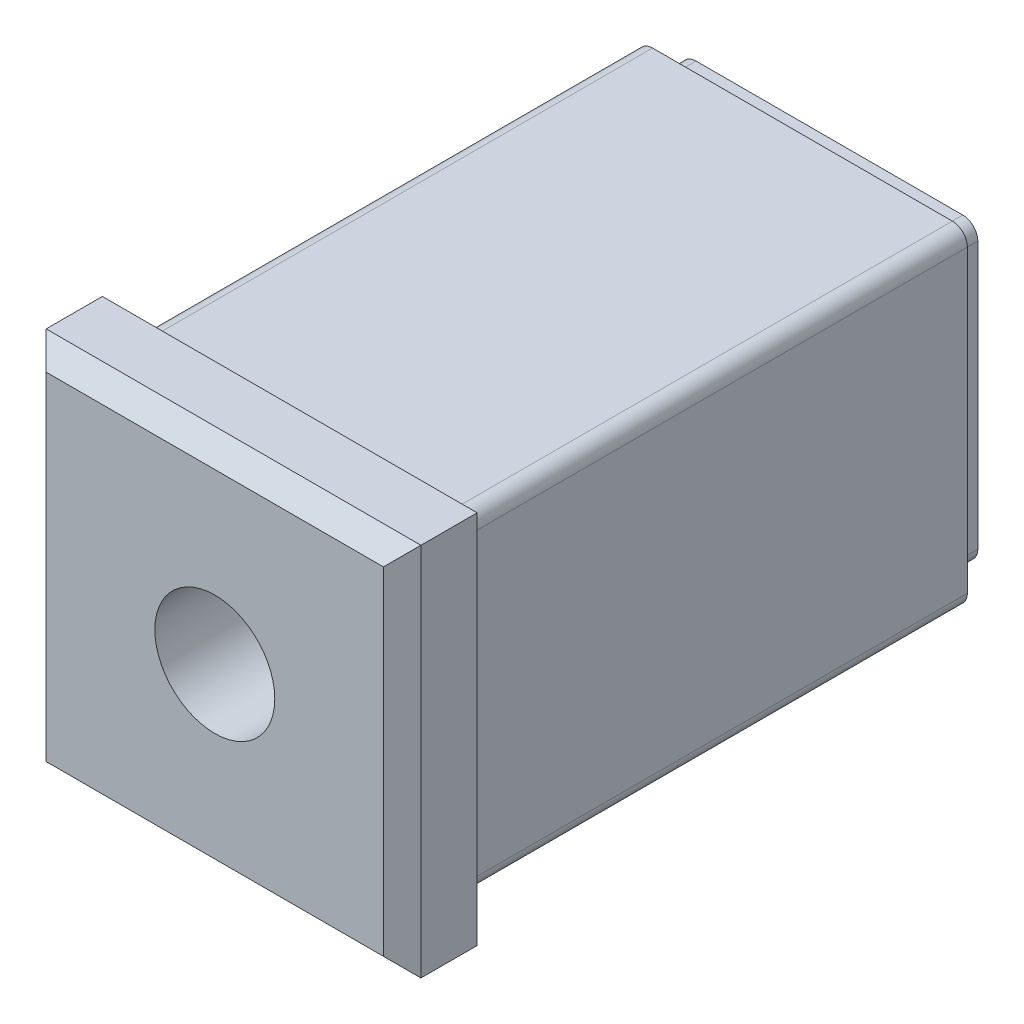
ISO-10303-21;
HEADER;
FILE_DESCRIPTION(('STEP AP214'),'2;1');
FILE_NAME('part.step','',(''),(''),'','','');
FILE_SCHEMA(('AUTOMOTIVE_DESIGN { 1 0 10303 214 1 1 1 1 }'));
ENDSEC;
DATA;
#1=APPLICATION_CONTEXT('core data for automotive mechanical design processes');
#2=APPLICATION_PROTOCOL_DEFINITION('international standard','automotive_design',2000,#1);
#3=PRODUCT_CONTEXT('',#1,'mechanical');
#4=PRODUCT('Part','Part','',(#3));
#5=PRODUCT_RELATED_PRODUCT_CATEGORY('part','',(#4));
#6=PRODUCT_DEFINITION_FORMATION('','',#4);
#7=PRODUCT_DEFINITION_CONTEXT('part definition',#1,'design');
#8=PRODUCT_DEFINITION('design','',#6,#7);
#9=PRODUCT_DEFINITION_SHAPE('','',#8);
#10=(LENGTH_UNIT() NAMED_UNIT(*) SI_UNIT(.MILLI.,.METRE.));
#11=(NAMED_UNIT(*) PLANE_ANGLE_UNIT() SI_UNIT($,.RADIAN.));
#12=(NAMED_UNIT(*) SI_UNIT($,.STERADIAN.) SOLID_ANGLE_UNIT());
#13=UNCERTAINTY_MEASURE_WITH_UNIT(LENGTH_MEASURE(1.E-05),#10,'distance_accuracy_value','');
#14=(GEOMETRIC_REPRESENTATION_CONTEXT(3) GLOBAL_UNCERTAINTY_ASSIGNED_CONTEXT((#13)) GLOBAL_UNIT_ASSIGNED_CONTEXT((#10,
#11,#12)) REPRESENTATION_CONTEXT('',''));
#15=CARTESIAN_POINT('',(0.,0.,0.));
#16=DIRECTION('',(0.,0.,1.));
#17=DIRECTION('',(1.,0.,0.));
#18=AXIS2_PLACEMENT_3D('',#15,#16,#17);
#19=CARTESIAN_POINT('',(-11.25,0.,5.));
#20=DIRECTION('',(0.,0.,1.));
#21=DIRECTION('',(0.,1.,0.));
#22=AXIS2_PLACEMENT_3D('',#19,#20,#21);
#23=PLANE('',#22);
#24=DIRECTION('',(0.,-1.,0.));
#25=VECTOR('',#24,1.);
#26=CARTESIAN_POINT('',(11.25,0.,5.));
#27=LINE('',#26,#25);
#28=CARTESIAN_POINT('',(11.25,11.25,5.));
#29=VERTEX_POINT('',#28);
#30=CARTESIAN_POINT('',(11.25,-11.25,5.));
#31=VERTEX_POINT('',#30);
#32=EDGE_CURVE('E237',#29,#31,#27,.T.);
#33=ORIENTED_EDGE('',*,*,#32,.F.);
#34=DIRECTION('',(-1.,0.,0.));
#35=VECTOR('',#34,1.);
#36=CARTESIAN_POINT('',(-25.,11.25,5.));
#37=LINE('',#36,#35);
#38=CARTESIAN_POINT('',(-11.25,11.25,5.));
#39=VERTEX_POINT('',#38);
#40=EDGE_CURVE('E188',#29,#39,#37,.T.);
#41=ORIENTED_EDGE('',*,*,#40,.T.);
#42=DIRECTION('',(0.,-1.,0.));
#43=VECTOR('',#42,1.);
#44=CARTESIAN_POINT('',(-11.25,0.,5.));
#45=LINE('',#44,#43);
#46=CARTESIAN_POINT('',(-11.25,-11.25,5.));
#47=VERTEX_POINT('',#46);
#48=EDGE_CURVE('E347',#47,#39,#45,.F.);
#49=ORIENTED_EDGE('',*,*,#48,.F.);
#50=DIRECTION('',(-1.,0.,0.));
#51=VECTOR('',#50,1.);
#52=CARTESIAN_POINT('',(36.,-11.25,5.));
#53=LINE('',#52,#51);
#54=EDGE_CURVE('E360',#47,#31,#53,.F.);
#55=ORIENTED_EDGE('',*,*,#54,.T.);
#56=EDGE_LOOP('',(#33,#41,#49,#55));
#57=FACE_BOUND('',#56,.T.);
#58=CARTESIAN_POINT('',(0.,0.,5.));
#59=DIRECTION('',(0.,0.,1.));
#60=DIRECTION('',(0.,1.,0.));
#61=AXIS2_PLACEMENT_3D('',#58,#59,#60);
#62=CIRCLE('',#61,4.);
#63=CARTESIAN_POINT('',(0.,4.,5.));
#64=VERTEX_POINT('',#63);
#65=EDGE_CURVE('E191',#64,#64,#62,.F.);
#66=ORIENTED_EDGE('',*,*,#65,.T.);
#67=EDGE_LOOP('',(#66));
#68=FACE_BOUND('',#67,.T.);
#69=ADVANCED_FACE('F14',(#57,#68),#23,.T.);
#70=CARTESIAN_POINT('',(36.,-12.5,3.75));
#71=DIRECTION('',(0.,0.707106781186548,-0.707106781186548));
#72=DIRECTION('',(0.,-0.707106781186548,-0.707106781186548));
#73=AXIS2_PLACEMENT_3D('',#70,#71,#72);
#74=PLANE('',#73);
#75=DIRECTION('',(1.,0.,0.));
#76=VECTOR('',#75,1.);
#77=CARTESIAN_POINT('',(0.,-12.5,3.75));
#78=LINE('',#77,#76);
#79=CARTESIAN_POINT('',(-12.5,-12.5,3.75));
#80=VERTEX_POINT('',#79);
#81=CARTESIAN_POINT('',(12.5,-12.5,3.75));
#82=VERTEX_POINT('',#81);
#83=EDGE_CURVE('E338',#80,#82,#78,.T.);
#84=ORIENTED_EDGE('',*,*,#83,.T.);
#85=DIRECTION('',(0.577350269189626,-0.577350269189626,-0.577350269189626));
#86=VECTOR('',#85,1.);
#87=CARTESIAN_POINT('',(11.25,-11.25,5.));
#88=LINE('',#87,#86);
#89=EDGE_CURVE('E363',#31,#82,#88,.T.);
#90=ORIENTED_EDGE('',*,*,#89,.F.);
#91=ORIENTED_EDGE('',*,*,#54,.F.);
#92=DIRECTION('',(0.577350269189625,0.577350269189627,0.577350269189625));
#93=VECTOR('',#92,1.);
#94=CARTESIAN_POINT('',(-12.5,-12.5,3.75));
#95=LINE('',#94,#93);
#96=EDGE_CURVE('E349',#80,#47,#95,.T.);
#97=ORIENTED_EDGE('',*,*,#96,.F.);
#98=EDGE_LOOP('',(#84,#90,#91,#97));
#99=FACE_BOUND('',#98,.T.);
#100=ADVANCED_FACE('F441',(#99),#74,.F.);
#101=CARTESIAN_POINT('',(11.25,0.,5.));
#102=DIRECTION('',(0.707106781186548,0.,0.707106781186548));
#103=DIRECTION('',(-0.707106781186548,0.,0.707106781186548));
#104=AXIS2_PLACEMENT_3D('',#101,#102,#103);
#105=PLANE('',#104);
#106=DIRECTION('',(0.,-1.,0.));
#107=VECTOR('',#106,1.);
#108=CARTESIAN_POINT('',(12.5,0.,3.75));
#109=LINE('',#108,#107);
#110=CARTESIAN_POINT('',(12.5,12.5,3.75));
#111=VERTEX_POINT('',#110);
#112=EDGE_CURVE('E18',#111,#82,#109,.T.);
#113=ORIENTED_EDGE('',*,*,#112,.F.);
#114=DIRECTION('',(-0.577350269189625,-0.577350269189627,0.577350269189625));
#115=VECTOR('',#114,1.);
#116=CARTESIAN_POINT('',(12.5,12.5,3.75));
#117=LINE('',#116,#115);
#118=EDGE_CURVE('E164',#111,#29,#117,.T.);
#119=ORIENTED_EDGE('',*,*,#118,.T.);
#120=ORIENTED_EDGE('',*,*,#32,.T.);
#121=ORIENTED_EDGE('',*,*,#89,.T.);
#122=EDGE_LOOP('',(#113,#119,#120,#121));
#123=FACE_BOUND('',#122,.T.);
#124=ADVANCED_FACE('F443',(#123),#105,.T.);
#125=CARTESIAN_POINT('',(-12.5,0.,3.75));
#126=DIRECTION('',(-0.707106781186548,0.,0.707106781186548));
#127=DIRECTION('',(-0.707106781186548,0.,-0.707106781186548));
#128=AXIS2_PLACEMENT_3D('',#125,#126,#127);
#129=PLANE('',#128);
#130=ORIENTED_EDGE('',*,*,#48,.T.);
#131=DIRECTION('',(-0.577350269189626,0.577350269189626,-0.577350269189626));
#132=VECTOR('',#131,1.);
#133=CARTESIAN_POINT('',(-11.25,11.25,5.));
#134=LINE('',#133,#132);
#135=CARTESIAN_POINT('',(-12.5,12.5,3.75));
#136=VERTEX_POINT('',#135);
#137=EDGE_CURVE('E187',#39,#136,#134,.T.);
#138=ORIENTED_EDGE('',*,*,#137,.T.);
#139=DIRECTION('',(0.,1.,0.));
#140=VECTOR('',#139,1.);
#141=CARTESIAN_POINT('',(-12.5,0.,3.75));
#142=LINE('',#141,#140);
#143=EDGE_CURVE('E333',#80,#136,#142,.T.);
#144=ORIENTED_EDGE('',*,*,#143,.F.);
#145=ORIENTED_EDGE('',*,*,#96,.T.);
#146=EDGE_LOOP('',(#130,#138,#144,#145));
#147=FACE_BOUND('',#146,.T.);
#148=ADVANCED_FACE('F446',(#147),#129,.T.);
#149=CARTESIAN_POINT('',(12.5,0.,-36.));
#150=DIRECTION('',(0.,0.,-1.));
#151=DIRECTION('',(0.,-1.,0.));
#152=AXIS2_PLACEMENT_3D('',#149,#150,#151);
#153=PLANE('',#152);
#154=DIRECTION('',(1.,0.,0.));
#155=VECTOR('',#154,1.);
#156=CARTESIAN_POINT('',(8.9,-9.9,-36.));
#157=LINE('',#156,#155);
#158=CARTESIAN_POINT('',(8.9,-9.9,-36.));
#159=VERTEX_POINT('',#158);
#160=CARTESIAN_POINT('',(-8.9,-9.9,-36.));
#161=VERTEX_POINT('',#160);
#162=EDGE_CURVE('E322',#159,#161,#157,.F.);
#163=ORIENTED_EDGE('',*,*,#162,.T.);
#164=CARTESIAN_POINT('',(-8.9,-8.9,-36.));
#165=DIRECTION('',(0.,0.,1.));
#166=DIRECTION('',(0.,1.,0.));
#167=AXIS2_PLACEMENT_3D('',#164,#165,#166);
#168=CIRCLE('',#167,1.);
#169=CARTESIAN_POINT('',(-9.9,-8.9,-36.));
#170=VERTEX_POINT('',#169);
#171=EDGE_CURVE('E375',#161,#170,#168,.F.);
#172=ORIENTED_EDGE('',*,*,#171,.T.);
#173=DIRECTION('',(0.,-1.,0.));
#174=VECTOR('',#173,1.);
#175=CARTESIAN_POINT('',(-9.9,-8.9,-36.));
#176=LINE('',#175,#174);
#177=CARTESIAN_POINT('',(-9.9,8.9,-36.));
#178=VERTEX_POINT('',#177);
#179=EDGE_CURVE('E327',#170,#178,#176,.F.);
#180=ORIENTED_EDGE('',*,*,#179,.T.);
#181=CARTESIAN_POINT('',(-8.9,8.9,-36.));
#182=DIRECTION('',(0.,0.,1.));
#183=DIRECTION('',(0.,1.,0.));
#184=AXIS2_PLACEMENT_3D('',#181,#182,#183);
#185=CIRCLE('',#184,1.);
#186=CARTESIAN_POINT('',(-8.9,9.9,-36.));
#187=VERTEX_POINT('',#186);
#188=EDGE_CURVE('E211',#178,#187,#185,.F.);
#189=ORIENTED_EDGE('',*,*,#188,.T.);
#190=DIRECTION('',(-1.,0.,0.));
#191=VECTOR('',#190,1.);
#192=CARTESIAN_POINT('',(-8.9,9.9,-36.));
#193=LINE('',#192,#191);
#194=CARTESIAN_POINT('',(8.9,9.9,-36.));
#195=VERTEX_POINT('',#194);
#196=EDGE_CURVE('E181',#187,#195,#193,.F.);
#197=ORIENTED_EDGE('',*,*,#196,.T.);
#198=CARTESIAN_POINT('',(8.9,8.9,-36.));
#199=DIRECTION('',(0.,0.,1.));
#200=DIRECTION('',(0.,1.,0.));
#201=AXIS2_PLACEMENT_3D('',#198,#199,#200);
#202=CIRCLE('',#201,1.);
#203=CARTESIAN_POINT('',(9.9,8.9,-36.));
#204=VERTEX_POINT('',#203);
#205=EDGE_CURVE('E193',#195,#204,#202,.F.);
#206=ORIENTED_EDGE('',*,*,#205,.T.);
#207=DIRECTION('',(0.,1.,0.));
#208=VECTOR('',#207,1.);
#209=CARTESIAN_POINT('',(9.9,8.9,-36.));
#210=LINE('',#209,#208);
#211=CARTESIAN_POINT('',(9.9,-8.9,-36.));
#212=VERTEX_POINT('',#211);
#213=EDGE_CURVE('E167',#204,#212,#210,.F.);
#214=ORIENTED_EDGE('',*,*,#213,.T.);
#215=CARTESIAN_POINT('',(8.9,-8.9,-36.));
#216=DIRECTION('',(0.,0.,1.));
#217=DIRECTION('',(0.,1.,0.));
#218=AXIS2_PLACEMENT_3D('',#215,#216,#217);
#219=CIRCLE('',#218,1.);
#220=EDGE_CURVE('E377',#212,#159,#219,.F.);
#221=ORIENTED_EDGE('',*,*,#220,.T.);
#222=EDGE_LOOP('',(#163,#172,#180,#189,#197,#206,#214,#221));
#223=FACE_BOUND('',#222,.T.);
#224=CARTESIAN_POINT('',(0.,0.,-36.));
#225=DIRECTION('',(0.,0.,-1.));
#226=DIRECTION('',(0.,-1.,0.));
#227=AXIS2_PLACEMENT_3D('',#224,#225,#226);
#228=CIRCLE('',#227,4.);
#229=CARTESIAN_POINT('',(0.,-4.,-36.));
#230=VERTEX_POINT('',#229);
#231=EDGE_CURVE('E651',#230,#230,#228,.T.);
#232=ORIENTED_EDGE('',*,*,#231,.F.);
#233=EDGE_LOOP('',(#232));
#234=FACE_BOUND('',#233,.T.);
#235=ADVANCED_FACE('F389',(#223,#234),#153,.T.);
#236=CARTESIAN_POINT('',(-12.5,0.,-36.));
#237=DIRECTION('',(-1.,0.,0.));
#238=DIRECTION('',(0.,1.,0.));
#239=AXIS2_PLACEMENT_3D('',#236,#237,#238);
#240=PLANE('',#239);
#241=ORIENTED_EDGE('',*,*,#143,.T.);
#242=DIRECTION('',(0.,0.,-1.));
#243=VECTOR('',#242,1.);
#244=CARTESIAN_POINT('',(-12.5,12.5,5.));
#245=LINE('',#244,#243);
#246=CARTESIAN_POINT('',(-12.5,12.5,0.));
#247=VERTEX_POINT('',#246);
#248=EDGE_CURVE('E174',#136,#247,#245,.T.);
#249=ORIENTED_EDGE('',*,*,#248,.T.);
#250=DIRECTION('',(0.,-1.,0.));
#251=VECTOR('',#250,1.);
#252=CARTESIAN_POINT('',(-12.5,0.,0.));
#253=LINE('',#252,#251);
#254=CARTESIAN_POINT('',(-12.5,-12.5,0.));
#255=VERTEX_POINT('',#254);
#256=EDGE_CURVE('E309',#255,#247,#253,.F.);
#257=ORIENTED_EDGE('',*,*,#256,.F.);
#258=DIRECTION('',(0.,0.,-1.));
#259=VECTOR('',#258,1.);
#260=CARTESIAN_POINT('',(-12.5,-12.5,-36.));
#261=LINE('',#260,#259);
#262=EDGE_CURVE('E337',#255,#80,#261,.F.);
#263=ORIENTED_EDGE('',*,*,#262,.T.);
#264=EDGE_LOOP('',(#241,#249,#257,#263));
#265=FACE_BOUND('',#264,.T.);
#266=ADVANCED_FACE('F467',(#265),#240,.T.);
#267=CARTESIAN_POINT('',(0.,-12.5,5.));
#268=DIRECTION('',(0.,1.,0.));
#269=DIRECTION('',(1.,0.,0.));
#270=AXIS2_PLACEMENT_3D('',#267,#268,#269);
#271=PLANE('',#270);
#272=DIRECTION('',(0.,0.,-1.));
#273=VECTOR('',#272,1.);
#274=CARTESIAN_POINT('',(12.5,-12.5,5.));
#275=LINE('',#274,#273);
#276=CARTESIAN_POINT('',(12.5,-12.5,0.));
#277=VERTEX_POINT('',#276);
#278=EDGE_CURVE('E334',#82,#277,#275,.T.);
#279=ORIENTED_EDGE('',*,*,#278,.F.);
#280=ORIENTED_EDGE('',*,*,#83,.F.);
#281=ORIENTED_EDGE('',*,*,#262,.F.);
#282=DIRECTION('',(-1.,0.,0.));
#283=VECTOR('',#282,1.);
#284=CARTESIAN_POINT('',(0.,-12.5,0.));
#285=LINE('',#284,#283);
#286=EDGE_CURVE('E312',#277,#255,#285,.T.);
#287=ORIENTED_EDGE('',*,*,#286,.F.);
#288=EDGE_LOOP('',(#279,#280,#281,#287));
#289=FACE_BOUND('',#288,.T.);
#290=ADVANCED_FACE('F470',(#289),#271,.F.);
#291=CARTESIAN_POINT('',(12.5,0.,3.75));
#292=DIRECTION('',(1.,0.,0.));
#293=DIRECTION('',(0.,-1.,0.));
#294=AXIS2_PLACEMENT_3D('',#291,#292,#293);
#295=PLANE('',#294);
#296=ORIENTED_EDGE('',*,*,#112,.T.);
#297=ORIENTED_EDGE('',*,*,#278,.T.);
#298=DIRECTION('',(0.,-1.,0.));
#299=VECTOR('',#298,1.);
#300=CARTESIAN_POINT('',(12.5,0.,0.));
#301=LINE('',#300,#299);
#302=CARTESIAN_POINT('',(12.5,12.5,0.));
#303=VERTEX_POINT('',#302);
#304=EDGE_CURVE('E315',#303,#277,#301,.T.);
#305=ORIENTED_EDGE('',*,*,#304,.F.);
#306=DIRECTION('',(0.,0.,-1.));
#307=VECTOR('',#306,1.);
#308=CARTESIAN_POINT('',(12.5,12.5,-36.));
#309=LINE('',#308,#307);
#310=EDGE_CURVE('E169',#303,#111,#309,.F.);
#311=ORIENTED_EDGE('',*,*,#310,.T.);
#312=EDGE_LOOP('',(#296,#297,#305,#311));
#313=FACE_BOUND('',#312,.T.);
#314=ADVANCED_FACE('F474',(#313),#295,.T.);
#315=CARTESIAN_POINT('',(10.,-11.,0.));
#316=DIRECTION('',(0.,1.,0.));
#317=DIRECTION('',(1.,0.,0.));
#318=AXIS2_PLACEMENT_3D('',#315,#316,#317);
#319=PLANE('',#318);
#320=DIRECTION('',(0.,0.,-1.));
#321=VECTOR('',#320,1.);
#322=CARTESIAN_POINT('',(10.,-11.,0.));
#323=LINE('',#322,#321);
#324=CARTESIAN_POINT('',(10.,-11.,0.));
#325=VERTEX_POINT('',#324);
#326=CARTESIAN_POINT('',(10.,-11.,-34.2));
#327=VERTEX_POINT('',#326);
#328=EDGE_CURVE('E24',#325,#327,#323,.T.);
#329=ORIENTED_EDGE('',*,*,#328,.F.);
#330=DIRECTION('',(1.,0.,0.));
#331=VECTOR('',#330,1.);
#332=CARTESIAN_POINT('',(10.,-11.,0.));
#333=LINE('',#332,#331);
#334=CARTESIAN_POINT('',(-10.,-11.,0.));
#335=VERTEX_POINT('',#334);
#336=EDGE_CURVE('E279',#335,#325,#333,.T.);
#337=ORIENTED_EDGE('',*,*,#336,.F.);
#338=DIRECTION('',(0.,0.,-1.));
#339=VECTOR('',#338,1.);
#340=CARTESIAN_POINT('',(-10.,-11.,0.));
#341=LINE('',#340,#339);
#342=CARTESIAN_POINT('',(-10.,-11.,-34.2));
#343=VERTEX_POINT('',#342);
#344=EDGE_CURVE('E276',#343,#335,#341,.F.);
#345=ORIENTED_EDGE('',*,*,#344,.F.);
#346=DIRECTION('',(1.,0.,0.));
#347=VECTOR('',#346,1.);
#348=CARTESIAN_POINT('',(10.,-11.,-34.2));
#349=LINE('',#348,#347);
#350=EDGE_CURVE('E9',#327,#343,#349,.F.);
#351=ORIENTED_EDGE('',*,*,#350,.F.);
#352=EDGE_LOOP('',(#329,#337,#345,#351));
#353=FACE_BOUND('',#352,.T.);
#354=ADVANCED_FACE('F477',(#353),#319,.F.);
#355=CARTESIAN_POINT('',(10.,-10.,0.));
#356=DIRECTION('',(0.,0.,1.));
#357=DIRECTION('',(0.,1.,0.));
#358=AXIS2_PLACEMENT_3D('',#355,#356,#357);
#359=CYLINDRICAL_SURFACE('',#358,1.);
#360=CARTESIAN_POINT('',(10.,-10.,0.));
#361=DIRECTION('',(0.,0.,1.));
#362=DIRECTION('',(0.,1.,0.));
#363=AXIS2_PLACEMENT_3D('',#360,#361,#362);
#364=CIRCLE('',#363,1.);
#365=CARTESIAN_POINT('',(11.,-10.,0.));
#366=VERTEX_POINT('',#365);
#367=EDGE_CURVE('E295',#366,#325,#364,.F.);
#368=ORIENTED_EDGE('',*,*,#367,.T.);
#369=ORIENTED_EDGE('',*,*,#328,.T.);
#370=CARTESIAN_POINT('',(10.,-10.,-34.2));
#371=DIRECTION('',(0.,0.,1.));
#372=DIRECTION('',(0.,1.,0.));
#373=AXIS2_PLACEMENT_3D('',#370,#371,#372);
#374=CIRCLE('',#373,1.);
#375=CARTESIAN_POINT('',(11.,-10.,-34.2));
#376=VERTEX_POINT('',#375);
#377=EDGE_CURVE('E32',#376,#327,#374,.F.);
#378=ORIENTED_EDGE('',*,*,#377,.F.);
#379=DIRECTION('',(0.,0.,1.));
#380=VECTOR('',#379,1.);
#381=CARTESIAN_POINT('',(11.,-10.,0.));
#382=LINE('',#381,#380);
#383=EDGE_CURVE('E304',#376,#366,#382,.T.);
#384=ORIENTED_EDGE('',*,*,#383,.T.);
#385=EDGE_LOOP('',(#368,#369,#378,#384));
#386=FACE_BOUND('',#385,.T.);
#387=ADVANCED_FACE('F512',(#386),#359,.T.);
#388=CARTESIAN_POINT('',(11.,10.,0.));
#389=DIRECTION('',(-1.,0.,0.));
#390=DIRECTION('',(0.,1.,0.));
#391=AXIS2_PLACEMENT_3D('',#388,#389,#390);
#392=PLANE('',#391);
#393=DIRECTION('',(0.,-1.,0.));
#394=VECTOR('',#393,1.);
#395=CARTESIAN_POINT('',(11.,0.,-34.2));
#396=LINE('',#395,#394);
#397=CARTESIAN_POINT('',(11.,10.,-34.2));
#398=VERTEX_POINT('',#397);
#399=EDGE_CURVE('E153',#398,#376,#396,.T.);
#400=ORIENTED_EDGE('',*,*,#399,.F.);
#401=DIRECTION('',(0.,0.,1.));
#402=VECTOR('',#401,1.);
#403=CARTESIAN_POINT('',(11.,10.,0.));
#404=LINE('',#403,#402);
#405=CARTESIAN_POINT('',(11.,10.,0.));
#406=VERTEX_POINT('',#405);
#407=EDGE_CURVE('E244',#406,#398,#404,.F.);
#408=ORIENTED_EDGE('',*,*,#407,.F.);
#409=DIRECTION('',(0.,-1.,0.));
#410=VECTOR('',#409,1.);
#411=CARTESIAN_POINT('',(11.,0.,0.));
#412=LINE('',#411,#410);
#413=EDGE_CURVE('E302',#366,#406,#412,.F.);
#414=ORIENTED_EDGE('',*,*,#413,.F.);
#415=ORIENTED_EDGE('',*,*,#383,.F.);
#416=EDGE_LOOP('',(#400,#408,#414,#415));
#417=FACE_BOUND('',#416,.T.);
#418=ADVANCED_FACE('F405',(#417),#392,.F.);
#419=CARTESIAN_POINT('',(9.9,8.9,-34.2));
#420=DIRECTION('',(-1.,0.,0.));
#421=DIRECTION('',(0.,1.,0.));
#422=AXIS2_PLACEMENT_3D('',#419,#420,#421);
#423=PLANE('',#422);
#424=ORIENTED_EDGE('',*,*,#213,.F.);
#425=DIRECTION('',(0.,0.,-1.));
#426=VECTOR('',#425,1.);
#427=CARTESIAN_POINT('',(9.9,8.9,-34.2));
#428=LINE('',#427,#426);
#429=CARTESIAN_POINT('',(9.9,8.9,-34.2));
#430=VERTEX_POINT('',#429);
#431=EDGE_CURVE('E160',#430,#204,#428,.T.);
#432=ORIENTED_EDGE('',*,*,#431,.F.);
#433=DIRECTION('',(0.,-1.,0.));
#434=VECTOR('',#433,1.);
#435=CARTESIAN_POINT('',(9.9,0.,-34.2));
#436=LINE('',#435,#434);
#437=CARTESIAN_POINT('',(9.9,-8.9,-34.2));
#438=VERTEX_POINT('',#437);
#439=EDGE_CURVE('E146',#438,#430,#436,.F.);
#440=ORIENTED_EDGE('',*,*,#439,.F.);
#441=DIRECTION('',(0.,0.,-1.));
#442=VECTOR('',#441,1.);
#443=CARTESIAN_POINT('',(9.9,-8.9,-34.2));
#444=LINE('',#443,#442);
#445=EDGE_CURVE('E320',#212,#438,#444,.F.);
#446=ORIENTED_EDGE('',*,*,#445,.F.);
#447=EDGE_LOOP('',(#424,#432,#440,#446));
#448=FACE_BOUND('',#447,.T.);
#449=ADVANCED_FACE('F165',(#448),#423,.F.);
#450=CARTESIAN_POINT('',(8.9,-8.9,-34.2));
#451=DIRECTION('',(0.,0.,1.));
#452=DIRECTION('',(0.,1.,0.));
#453=AXIS2_PLACEMENT_3D('',#450,#451,#452);
#454=CYLINDRICAL_SURFACE('',#453,1.);
#455=CARTESIAN_POINT('',(8.9,-8.9,-34.2));
#456=DIRECTION('',(0.,0.,1.));
#457=DIRECTION('',(0.,1.,0.));
#458=AXIS2_PLACEMENT_3D('',#455,#456,#457);
#459=CIRCLE('',#458,1.);
#460=CARTESIAN_POINT('',(8.9,-9.9,-34.2));
#461=VERTEX_POINT('',#460);
#462=EDGE_CURVE('E149',#438,#461,#459,.F.);
#463=ORIENTED_EDGE('',*,*,#462,.T.);
#464=DIRECTION('',(0.,0.,-1.));
#465=VECTOR('',#464,1.);
#466=CARTESIAN_POINT('',(8.9,-9.9,-34.2));
#467=LINE('',#466,#465);
#468=EDGE_CURVE('E326',#461,#159,#467,.T.);
#469=ORIENTED_EDGE('',*,*,#468,.T.);
#470=ORIENTED_EDGE('',*,*,#220,.F.);
#471=ORIENTED_EDGE('',*,*,#445,.T.);
#472=EDGE_LOOP('',(#463,#469,#470,#471));
#473=FACE_BOUND('',#472,.T.);
#474=ADVANCED_FACE('F395',(#473),#454,.T.);
#475=CARTESIAN_POINT('',(8.9,-9.9,-34.2));
#476=DIRECTION('',(0.,1.,0.));
#477=DIRECTION('',(1.,0.,0.));
#478=AXIS2_PLACEMENT_3D('',#475,#476,#477);
#479=PLANE('',#478);
#480=ORIENTED_EDGE('',*,*,#468,.F.);
#481=DIRECTION('',(-1.,0.,0.));
#482=VECTOR('',#481,1.);
#483=CARTESIAN_POINT('',(0.,-9.9,-34.2));
#484=LINE('',#483,#482);
#485=CARTESIAN_POINT('',(-8.9,-9.9,-34.2));
#486=VERTEX_POINT('',#485);
#487=EDGE_CURVE('E154',#486,#461,#484,.F.);
#488=ORIENTED_EDGE('',*,*,#487,.F.);
#489=DIRECTION('',(0.,0.,-1.));
#490=VECTOR('',#489,1.);
#491=CARTESIAN_POINT('',(-8.9,-9.9,-34.2));
#492=LINE('',#491,#490);
#493=EDGE_CURVE('E323',#161,#486,#492,.F.);
#494=ORIENTED_EDGE('',*,*,#493,.F.);
#495=ORIENTED_EDGE('',*,*,#162,.F.);
#496=EDGE_LOOP('',(#480,#488,#494,#495));
#497=FACE_BOUND('',#496,.T.);
#498=ADVANCED_FACE('F394',(#497),#479,.F.);
#499=CARTESIAN_POINT('',(-8.9,-8.9,-34.2));
#500=DIRECTION('',(0.,0.,1.));
#501=DIRECTION('',(0.,1.,0.));
#502=AXIS2_PLACEMENT_3D('',#499,#500,#501);
#503=CYLINDRICAL_SURFACE('',#502,1.);
#504=CARTESIAN_POINT('',(-8.9,-8.9,-34.2));
#505=DIRECTION('',(0.,0.,1.));
#506=DIRECTION('',(0.,1.,0.));
#507=AXIS2_PLACEMENT_3D('',#504,#505,#506);
#508=CIRCLE('',#507,1.);
#509=CARTESIAN_POINT('',(-9.9,-8.9,-34.2));
#510=VERTEX_POINT('',#509);
#511=EDGE_CURVE('E228',#486,#510,#508,.F.);
#512=ORIENTED_EDGE('',*,*,#511,.T.);
#513=DIRECTION('',(0.,0.,-1.));
#514=VECTOR('',#513,1.);
#515=CARTESIAN_POINT('',(-9.9,-8.9,-34.2));
#516=LINE('',#515,#514);
#517=EDGE_CURVE('E330',#510,#170,#516,.T.);
#518=ORIENTED_EDGE('',*,*,#517,.T.);
#519=ORIENTED_EDGE('',*,*,#171,.F.);
#520=ORIENTED_EDGE('',*,*,#493,.T.);
#521=EDGE_LOOP('',(#512,#518,#519,#520));
#522=FACE_BOUND('',#521,.T.);
#523=ADVANCED_FACE('F382',(#522),#503,.T.);
#524=CARTESIAN_POINT('',(-9.9,-8.9,-34.2));
#525=DIRECTION('',(1.,0.,0.));
#526=DIRECTION('',(0.,-1.,0.));
#527=AXIS2_PLACEMENT_3D('',#524,#525,#526);
#528=PLANE('',#527);
#529=ORIENTED_EDGE('',*,*,#517,.F.);
#530=DIRECTION('',(0.,-1.,0.));
#531=VECTOR('',#530,1.);
#532=CARTESIAN_POINT('',(-9.9,0.,-34.2));
#533=LINE('',#532,#531);
#534=CARTESIAN_POINT('',(-9.9,8.9,-34.2));
#535=VERTEX_POINT('',#534);
#536=EDGE_CURVE('E293',#535,#510,#533,.T.);
#537=ORIENTED_EDGE('',*,*,#536,.F.);
#538=DIRECTION('',(0.,0.,-1.));
#539=VECTOR('',#538,1.);
#540=CARTESIAN_POINT('',(-9.9,8.9,-34.2));
#541=LINE('',#540,#539);
#542=EDGE_CURVE('E184',#178,#535,#541,.F.);
#543=ORIENTED_EDGE('',*,*,#542,.F.);
#544=ORIENTED_EDGE('',*,*,#179,.F.);
#545=EDGE_LOOP('',(#529,#537,#543,#544));
#546=FACE_BOUND('',#545,.T.);
#547=ADVANCED_FACE('F387',(#546),#528,.F.);
#548=CARTESIAN_POINT('',(-11.,-10.,0.));
#549=DIRECTION('',(1.,0.,0.));
#550=DIRECTION('',(0.,-1.,0.));
#551=AXIS2_PLACEMENT_3D('',#548,#549,#550);
#552=PLANE('',#551);
#553=DIRECTION('',(0.,0.,1.));
#554=VECTOR('',#553,1.);
#555=CARTESIAN_POINT('',(-11.,-10.,0.));
#556=LINE('',#555,#554);
#557=CARTESIAN_POINT('',(-11.,-10.,0.));
#558=VERTEX_POINT('',#557);
#559=CARTESIAN_POINT('',(-11.,-10.,-34.2));
#560=VERTEX_POINT('',#559);
#561=EDGE_CURVE('E316',#558,#560,#556,.F.);
#562=ORIENTED_EDGE('',*,*,#561,.F.);
#563=DIRECTION('',(0.,-1.,0.));
#564=VECTOR('',#563,1.);
#565=CARTESIAN_POINT('',(-11.,0.,0.));
#566=LINE('',#565,#564);
#567=CARTESIAN_POINT('',(-11.,10.,0.));
#568=VERTEX_POINT('',#567);
#569=EDGE_CURVE('E260',#568,#558,#566,.T.);
#570=ORIENTED_EDGE('',*,*,#569,.F.);
#571=DIRECTION('',(0.,0.,1.));
#572=VECTOR('',#571,1.);
#573=CARTESIAN_POINT('',(-11.,10.,0.));
#574=LINE('',#573,#572);
#575=CARTESIAN_POINT('',(-11.,10.,-34.2));
#576=VERTEX_POINT('',#575);
#577=EDGE_CURVE('E206',#576,#568,#574,.T.);
#578=ORIENTED_EDGE('',*,*,#577,.F.);
#579=DIRECTION('',(0.,-1.,0.));
#580=VECTOR('',#579,1.);
#581=CARTESIAN_POINT('',(-11.,0.,-34.2));
#582=LINE('',#581,#580);
#583=EDGE_CURVE('E272',#560,#576,#582,.F.);
#584=ORIENTED_EDGE('',*,*,#583,.F.);
#585=EDGE_LOOP('',(#562,#570,#578,#584));
#586=FACE_BOUND('',#585,.T.);
#587=ADVANCED_FACE('F458',(#586),#552,.F.);
#588=CARTESIAN_POINT('',(-10.,-10.,0.));
#589=DIRECTION('',(0.,0.,1.));
#590=DIRECTION('',(0.,1.,0.));
#591=AXIS2_PLACEMENT_3D('',#588,#589,#590);
#592=CYLINDRICAL_SURFACE('',#591,1.);
#593=CARTESIAN_POINT('',(-10.,-10.,0.));
#594=DIRECTION('',(0.,0.,1.));
#595=DIRECTION('',(0.,1.,0.));
#596=AXIS2_PLACEMENT_3D('',#593,#594,#595);
#597=CIRCLE('',#596,1.);
#598=EDGE_CURVE('E305',#558,#335,#597,.T.);
#599=ORIENTED_EDGE('',*,*,#598,.F.);
#600=ORIENTED_EDGE('',*,*,#561,.T.);
#601=CARTESIAN_POINT('',(-10.,-10.,-34.2));
#602=DIRECTION('',(0.,0.,1.));
#603=DIRECTION('',(0.,1.,0.));
#604=AXIS2_PLACEMENT_3D('',#601,#602,#603);
#605=CIRCLE('',#604,1.);
#606=EDGE_CURVE('E275',#343,#560,#605,.F.);
#607=ORIENTED_EDGE('',*,*,#606,.F.);
#608=ORIENTED_EDGE('',*,*,#344,.T.);
#609=EDGE_LOOP('',(#599,#600,#607,#608));
#610=FACE_BOUND('',#609,.T.);
#611=ADVANCED_FACE('F464',(#610),#592,.T.);
#612=CARTESIAN_POINT('',(0.,0.,-34.2));
#613=DIRECTION('',(0.,0.,-1.));
#614=DIRECTION('',(0.,-1.,0.));
#615=AXIS2_PLACEMENT_3D('',#612,#613,#614);
#616=PLANE('',#615);
#617=ORIENTED_EDGE('',*,*,#439,.T.);
#618=CARTESIAN_POINT('',(8.9,8.9,-34.2));
#619=DIRECTION('',(0.,0.,1.));
#620=DIRECTION('',(0.,1.,0.));
#621=AXIS2_PLACEMENT_3D('',#618,#619,#620);
#622=CIRCLE('',#621,1.);
#623=CARTESIAN_POINT('',(8.9,9.9,-34.2));
#624=VERTEX_POINT('',#623);
#625=EDGE_CURVE('E143',#624,#430,#622,.F.);
#626=ORIENTED_EDGE('',*,*,#625,.F.);
#627=DIRECTION('',(-1.,0.,0.));
#628=VECTOR('',#627,1.);
#629=CARTESIAN_POINT('',(0.,9.9,-34.2));
#630=LINE('',#629,#628);
#631=CARTESIAN_POINT('',(-8.9,9.9,-34.2));
#632=VERTEX_POINT('',#631);
#633=EDGE_CURVE('E203',#624,#632,#630,.T.);
#634=ORIENTED_EDGE('',*,*,#633,.T.);
#635=CARTESIAN_POINT('',(-8.9,8.9,-34.2));
#636=DIRECTION('',(0.,0.,1.));
#637=DIRECTION('',(0.,1.,0.));
#638=AXIS2_PLACEMENT_3D('',#635,#636,#637);
#639=CIRCLE('',#638,1.);
#640=EDGE_CURVE('E163',#535,#632,#639,.F.);
#641=ORIENTED_EDGE('',*,*,#640,.F.);
#642=ORIENTED_EDGE('',*,*,#536,.T.);
#643=ORIENTED_EDGE('',*,*,#511,.F.);
#644=ORIENTED_EDGE('',*,*,#487,.T.);
#645=ORIENTED_EDGE('',*,*,#462,.F.);
#646=EDGE_LOOP('',(#617,#626,#634,#641,#642,#643,#644,#645));
#647=FACE_BOUND('',#646,.T.);
#648=ORIENTED_EDGE('',*,*,#606,.T.);
#649=ORIENTED_EDGE('',*,*,#583,.T.);
#650=CARTESIAN_POINT('',(-10.,10.,-34.2));
#651=DIRECTION('',(0.,0.,1.));
#652=DIRECTION('',(0.,1.,0.));
#653=AXIS2_PLACEMENT_3D('',#650,#651,#652);
#654=CIRCLE('',#653,1.);
#655=CARTESIAN_POINT('',(-10.,11.,-34.2));
#656=VERTEX_POINT('',#655);
#657=EDGE_CURVE('E201',#576,#656,#654,.F.);
#658=ORIENTED_EDGE('',*,*,#657,.T.);
#659=DIRECTION('',(-1.,0.,0.));
#660=VECTOR('',#659,1.);
#661=CARTESIAN_POINT('',(-10.,11.,-34.2));
#662=LINE('',#661,#660);
#663=CARTESIAN_POINT('',(10.,11.,-34.2));
#664=VERTEX_POINT('',#663);
#665=EDGE_CURVE('E233',#656,#664,#662,.F.);
#666=ORIENTED_EDGE('',*,*,#665,.T.);
#667=CARTESIAN_POINT('',(10.,10.,-34.2));
#668=DIRECTION('',(0.,0.,1.));
#669=DIRECTION('',(0.,1.,0.));
#670=AXIS2_PLACEMENT_3D('',#667,#668,#669);
#671=CIRCLE('',#670,1.);
#672=EDGE_CURVE('E197',#664,#398,#671,.F.);
#673=ORIENTED_EDGE('',*,*,#672,.T.);
#674=ORIENTED_EDGE('',*,*,#399,.T.);
#675=ORIENTED_EDGE('',*,*,#377,.T.);
#676=ORIENTED_EDGE('',*,*,#350,.T.);
#677=EDGE_LOOP('',(#648,#649,#658,#666,#673,#674,#675,#676));
#678=FACE_BOUND('',#677,.T.);
#679=ADVANCED_FACE('F147',(#647,#678),#616,.T.);
#680=CARTESIAN_POINT('',(0.,0.,0.));
#681=DIRECTION('',(0.,0.,-1.));
#682=DIRECTION('',(0.,-1.,0.));
#683=AXIS2_PLACEMENT_3D('',#680,#681,#682);
#684=PLANE('',#683);
#685=ORIENTED_EDGE('',*,*,#413,.T.);
#686=CARTESIAN_POINT('',(10.,10.,0.));
#687=DIRECTION('',(0.,0.,1.));
#688=DIRECTION('',(0.,1.,0.));
#689=AXIS2_PLACEMENT_3D('',#686,#687,#688);
#690=CIRCLE('',#689,1.);
#691=CARTESIAN_POINT('',(10.,11.,0.));
#692=VERTEX_POINT('',#691);
#693=EDGE_CURVE('E207',#406,#692,#690,.T.);
#694=ORIENTED_EDGE('',*,*,#693,.T.);
#695=DIRECTION('',(-1.,0.,0.));
#696=VECTOR('',#695,1.);
#697=CARTESIAN_POINT('',(-10.,11.,0.));
#698=LINE('',#697,#696);
#699=CARTESIAN_POINT('',(-10.,11.,0.));
#700=VERTEX_POINT('',#699);
#701=EDGE_CURVE('E234',#692,#700,#698,.T.);
#702=ORIENTED_EDGE('',*,*,#701,.T.);
#703=CARTESIAN_POINT('',(-10.,10.,0.));
#704=DIRECTION('',(0.,0.,1.));
#705=DIRECTION('',(0.,1.,0.));
#706=AXIS2_PLACEMENT_3D('',#703,#704,#705);
#707=CIRCLE('',#706,1.);
#708=EDGE_CURVE('E204',#568,#700,#707,.F.);
#709=ORIENTED_EDGE('',*,*,#708,.F.);
#710=ORIENTED_EDGE('',*,*,#569,.T.);
#711=ORIENTED_EDGE('',*,*,#598,.T.);
#712=ORIENTED_EDGE('',*,*,#336,.T.);
#713=ORIENTED_EDGE('',*,*,#367,.F.);
#714=EDGE_LOOP('',(#685,#694,#702,#709,#710,#711,#712,#713));
#715=FACE_BOUND('',#714,.T.);
#716=DIRECTION('',(-1.,0.,0.));
#717=VECTOR('',#716,1.);
#718=CARTESIAN_POINT('',(0.,12.5,0.));
#719=LINE('',#718,#717);
#720=EDGE_CURVE('E209',#247,#303,#719,.F.);
#721=ORIENTED_EDGE('',*,*,#720,.T.);
#722=ORIENTED_EDGE('',*,*,#304,.T.);
#723=ORIENTED_EDGE('',*,*,#286,.T.);
#724=ORIENTED_EDGE('',*,*,#256,.T.);
#725=EDGE_LOOP('',(#721,#722,#723,#724));
#726=FACE_BOUND('',#725,.T.);
#727=ADVANCED_FACE('F258',(#715,#726),#684,.T.);
#728=CARTESIAN_POINT('',(-25.,12.5,3.75));
#729=DIRECTION('',(0.,-0.707106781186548,-0.707106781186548));
#730=DIRECTION('',(0.,-0.707106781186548,0.707106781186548));
#731=AXIS2_PLACEMENT_3D('',#728,#729,#730);
#732=PLANE('',#731);
#733=DIRECTION('',(-1.,0.,0.));
#734=VECTOR('',#733,1.);
#735=CARTESIAN_POINT('',(0.,12.5,3.75));
#736=LINE('',#735,#734);
#737=EDGE_CURVE('E180',#111,#136,#736,.T.);
#738=ORIENTED_EDGE('',*,*,#737,.T.);
#739=ORIENTED_EDGE('',*,*,#137,.F.);
#740=ORIENTED_EDGE('',*,*,#40,.F.);
#741=ORIENTED_EDGE('',*,*,#118,.F.);
#742=EDGE_LOOP('',(#738,#739,#740,#741));
#743=FACE_BOUND('',#742,.T.);
#744=ADVANCED_FACE('F16',(#743),#732,.F.);
#745=CARTESIAN_POINT('',(0.,12.5,5.));
#746=DIRECTION('',(0.,-1.,0.));
#747=DIRECTION('',(-1.,0.,0.));
#748=AXIS2_PLACEMENT_3D('',#745,#746,#747);
#749=PLANE('',#748);
#750=ORIENTED_EDGE('',*,*,#248,.F.);
#751=ORIENTED_EDGE('',*,*,#737,.F.);
#752=ORIENTED_EDGE('',*,*,#310,.F.);
#753=ORIENTED_EDGE('',*,*,#720,.F.);
#754=EDGE_LOOP('',(#750,#751,#752,#753));
#755=FACE_BOUND('',#754,.T.);
#756=ADVANCED_FACE('F410',(#755),#749,.F.);
#757=CARTESIAN_POINT('',(-10.,11.,0.));
#758=DIRECTION('',(0.,-1.,0.));
#759=DIRECTION('',(-1.,0.,0.));
#760=AXIS2_PLACEMENT_3D('',#757,#758,#759);
#761=PLANE('',#760);
#762=DIRECTION('',(0.,0.,-1.));
#763=VECTOR('',#762,1.);
#764=CARTESIAN_POINT('',(-10.,11.,0.));
#765=LINE('',#764,#763);
#766=EDGE_CURVE('E230',#700,#656,#765,.T.);
#767=ORIENTED_EDGE('',*,*,#766,.F.);
#768=ORIENTED_EDGE('',*,*,#701,.F.);
#769=DIRECTION('',(0.,0.,-1.));
#770=VECTOR('',#769,1.);
#771=CARTESIAN_POINT('',(10.,11.,0.));
#772=LINE('',#771,#770);
#773=EDGE_CURVE('E200',#664,#692,#772,.F.);
#774=ORIENTED_EDGE('',*,*,#773,.F.);
#775=ORIENTED_EDGE('',*,*,#665,.F.);
#776=EDGE_LOOP('',(#767,#768,#774,#775));
#777=FACE_BOUND('',#776,.T.);
#778=ADVANCED_FACE('F265',(#777),#761,.F.);
#779=CARTESIAN_POINT('',(-10.,10.,0.));
#780=DIRECTION('',(0.,0.,1.));
#781=DIRECTION('',(0.,1.,0.));
#782=AXIS2_PLACEMENT_3D('',#779,#780,#781);
#783=CYLINDRICAL_SURFACE('',#782,1.);
#784=ORIENTED_EDGE('',*,*,#708,.T.);
#785=ORIENTED_EDGE('',*,*,#766,.T.);
#786=ORIENTED_EDGE('',*,*,#657,.F.);
#787=ORIENTED_EDGE('',*,*,#577,.T.);
#788=EDGE_LOOP('',(#784,#785,#786,#787));
#789=FACE_BOUND('',#788,.T.);
#790=ADVANCED_FACE('F253',(#789),#783,.T.);
#791=CARTESIAN_POINT('',(-8.9,8.9,-34.2));
#792=DIRECTION('',(0.,0.,1.));
#793=DIRECTION('',(0.,1.,0.));
#794=AXIS2_PLACEMENT_3D('',#791,#792,#793);
#795=CYLINDRICAL_SURFACE('',#794,1.);
#796=ORIENTED_EDGE('',*,*,#640,.T.);
#797=DIRECTION('',(0.,0.,-1.));
#798=VECTOR('',#797,1.);
#799=CARTESIAN_POINT('',(-8.9,9.9,-34.2));
#800=LINE('',#799,#798);
#801=EDGE_CURVE('E171',#632,#187,#800,.T.);
#802=ORIENTED_EDGE('',*,*,#801,.T.);
#803=ORIENTED_EDGE('',*,*,#188,.F.);
#804=ORIENTED_EDGE('',*,*,#542,.T.);
#805=EDGE_LOOP('',(#796,#802,#803,#804));
#806=FACE_BOUND('',#805,.T.);
#807=ADVANCED_FACE('F218',(#806),#795,.T.);
#808=CARTESIAN_POINT('',(-8.9,9.9,-34.2));
#809=DIRECTION('',(0.,-1.,0.));
#810=DIRECTION('',(-1.,0.,0.));
#811=AXIS2_PLACEMENT_3D('',#808,#809,#810);
#812=PLANE('',#811);
#813=ORIENTED_EDGE('',*,*,#801,.F.);
#814=ORIENTED_EDGE('',*,*,#633,.F.);
#815=DIRECTION('',(0.,0.,-1.));
#816=VECTOR('',#815,1.);
#817=CARTESIAN_POINT('',(8.9,9.9,-34.2));
#818=LINE('',#817,#816);
#819=EDGE_CURVE('E161',#195,#624,#818,.F.);
#820=ORIENTED_EDGE('',*,*,#819,.F.);
#821=ORIENTED_EDGE('',*,*,#196,.F.);
#822=EDGE_LOOP('',(#813,#814,#820,#821));
#823=FACE_BOUND('',#822,.T.);
#824=ADVANCED_FACE('F224',(#823),#812,.F.);
#825=CARTESIAN_POINT('',(8.9,8.9,-34.2));
#826=DIRECTION('',(0.,0.,1.));
#827=DIRECTION('',(0.,1.,0.));
#828=AXIS2_PLACEMENT_3D('',#825,#826,#827);
#829=CYLINDRICAL_SURFACE('',#828,1.);
#830=ORIENTED_EDGE('',*,*,#625,.T.);
#831=ORIENTED_EDGE('',*,*,#431,.T.);
#832=ORIENTED_EDGE('',*,*,#205,.F.);
#833=ORIENTED_EDGE('',*,*,#819,.T.);
#834=EDGE_LOOP('',(#830,#831,#832,#833));
#835=FACE_BOUND('',#834,.T.);
#836=ADVANCED_FACE('F158',(#835),#829,.T.);
#837=CARTESIAN_POINT('',(10.,10.,0.));
#838=DIRECTION('',(0.,0.,1.));
#839=DIRECTION('',(0.,1.,0.));
#840=AXIS2_PLACEMENT_3D('',#837,#838,#839);
#841=CYLINDRICAL_SURFACE('',#840,1.);
#842=ORIENTED_EDGE('',*,*,#693,.F.);
#843=ORIENTED_EDGE('',*,*,#407,.T.);
#844=ORIENTED_EDGE('',*,*,#672,.F.);
#845=ORIENTED_EDGE('',*,*,#773,.T.);
#846=EDGE_LOOP('',(#842,#843,#844,#845));
#847=FACE_BOUND('',#846,.T.);
#848=ADVANCED_FACE('F269',(#847),#841,.T.);
#849=CARTESIAN_POINT('',(0.,0.,31.1306078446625));
#850=DIRECTION('',(0.,0.,-1.));
#851=DIRECTION('',(0.,-1.,0.));
#852=AXIS2_PLACEMENT_3D('',#849,#850,#851);
#853=CYLINDRICAL_SURFACE('',#852,4.);
#854=ORIENTED_EDGE('',*,*,#231,.T.);
#855=EDGE_LOOP('',(#854));
#856=FACE_BOUND('',#855,.T.);
#857=ORIENTED_EDGE('',*,*,#65,.F.);
#858=EDGE_LOOP('',(#857));
#859=FACE_BOUND('',#858,.T.);
#860=ADVANCED_FACE('F420',(#856,#859),#853,.F.);
#861=CLOSED_SHELL('',(#69,#100,#124,#148,#235,#266,#290,#314,#354,#387,#418,#449,#474,#498,#523,
#547,#587,#611,#679,#727,#744,#756,#778,#790,#807,#824,#836,#848,#860));
#862=MANIFOLD_SOLID_BREP('B1',#861);
#863=ADVANCED_BREP_SHAPE_REPRESENTATION('',(#18,#862),#14);
#864=SHAPE_DEFINITION_REPRESENTATION(#9,#863);
ENDSEC;
END-ISO-10303-21;
